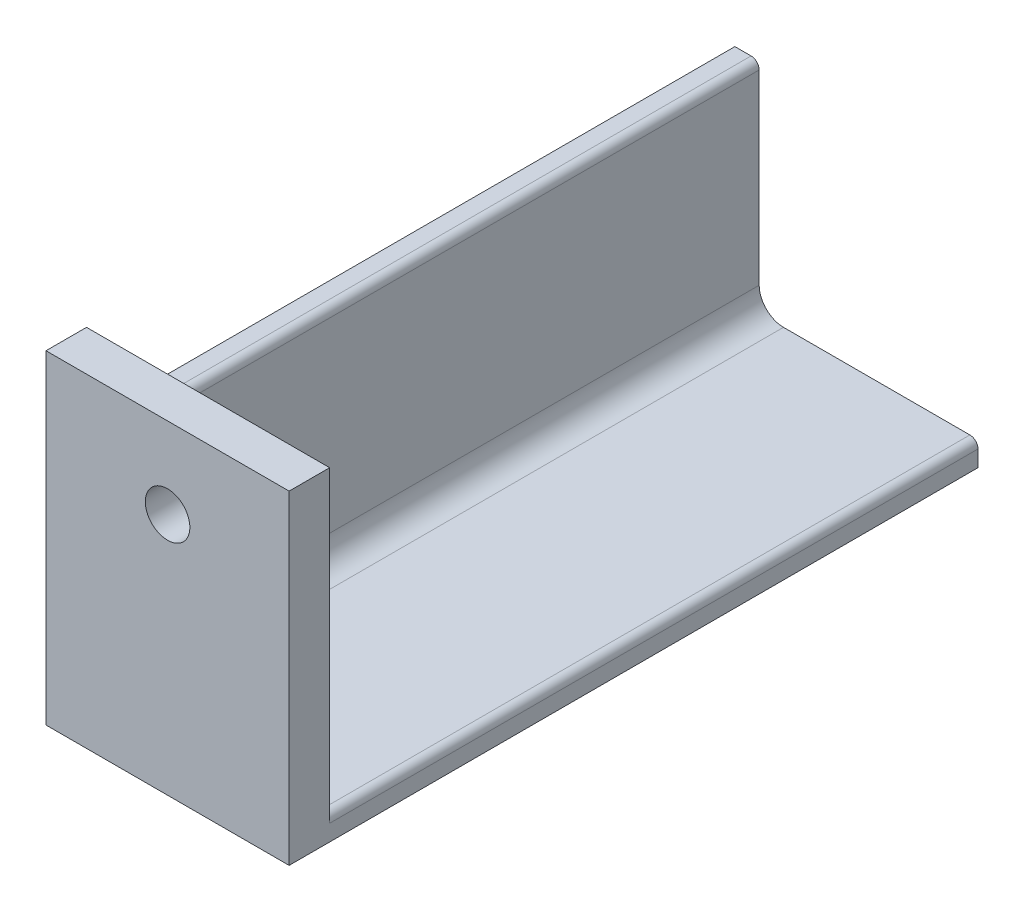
from build123d import *

# Parameters (mm, degrees)
BOSS_EXTRUDE1_DEPTH = 160
SKETCH2_W           = 60
SKETCH2_H           = 80
BOSS_EXTRUDE2_DEPTH = 10
SKETCH3_R           = 5.5
CUT_EXTRUDE1_DEPTH  = 10


with BuildPart() as part:
    # Sketch1 → Boss-Extrude1 (new body)
    with BuildSketch(Plane.XY):
        with BuildLine():
            Line((0, 60), (0, 0))
            Line((0, 0), (60, 0))
            Line((60, 0), (60, 4))
            ThreePointArc((60, 4), (59.414213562, 5.414213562), (58, 6))
            Line((58, 6), (12, 6))
            ThreePointArc((12, 6), (7.757359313, 7.757359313), (6, 12))
            Line((6, 12), (6, 58))
            ThreePointArc((6, 58), (5.414213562, 59.414213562), (4, 60))
            Line((4, 60), (0, 60))
        make_face()
    extrude(amount=BOSS_EXTRUDE1_DEPTH)

    # Sketch2 → Boss-Extrude2 (add)
    with BuildSketch(Plane.XY.offset(160)):
        with Locations((30, 40)):
            Rectangle(SKETCH2_W, SKETCH2_H)
    extrude(amount=BOSS_EXTRUDE2_DEPTH)

    # Sketch3 → Cut-Extrude1 (cut)
    with BuildSketch(Plane(origin=(0, 0, 160), x_dir=(-1, 0, 0), z_dir=(0, 0, -1))):
        with Locations((-30, 60)):
            Circle(SKETCH3_R)
    extrude(amount=-CUT_EXTRUDE1_DEPTH, mode=Mode.SUBTRACT)


solid = part.part
